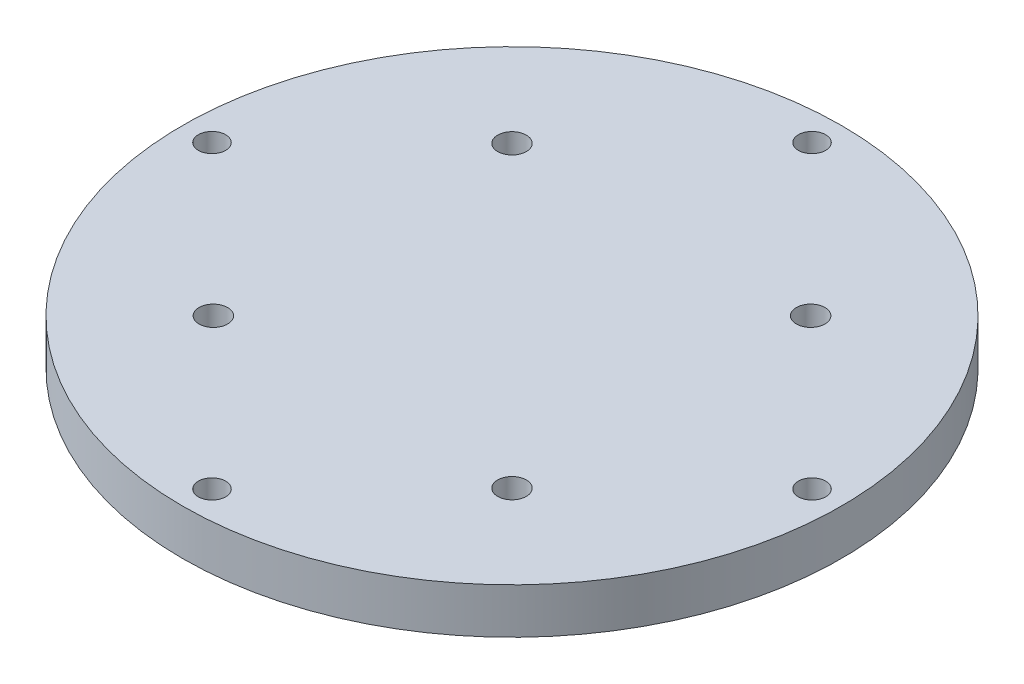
from build123d import *

# Parameters (mm, degrees)
SKETCH1_R           = 46.0375
SKETCH1_R_2         = 1.905
SKETCH1_R_3         = 2
BOSS_EXTRUDE1_DEPTH = 6.35


with BuildPart() as part:
    # Sketch1 → Boss-Extrude1 (new body)
    with BuildSketch(Plane(origin=(0, 0, 0), x_dir=(1, 0, 0), z_dir=(0, 1, 0))):
        with Locations(Location((0, 0, 0), (0, 0, 270))):
            Circle(SKETCH1_R)
        with Locations(Location((0, 41.91, 0), (0, 0, 270))):
            Circle(SKETCH1_R_2, mode=Mode.SUBTRACT)
        with Locations(Location((41.91, 0, 0), (0, 0, 270))):
            Circle(SKETCH1_R_2, mode=Mode.SUBTRACT)
        with Locations(Location((0, -41.91, 0), (0, 0, 270))):
            Circle(SKETCH1_R_2, mode=Mode.SUBTRACT)
        with Locations(Location((-41.91, 0, 0), (0, 0, 270))):
            Circle(SKETCH1_R_2, mode=Mode.SUBTRACT)
        with Locations(Location((-20.859650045, 20.859650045, 0), (0, 0, 270))):
            Circle(SKETCH1_R_3, mode=Mode.SUBTRACT)
        with Locations(Location((20.859650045, 20.859650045, 0), (0, 0, 270))):
            Circle(SKETCH1_R_3, mode=Mode.SUBTRACT)
        with Locations(Location((20.859650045, -20.859650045, 0), (0, 0, 270))):
            Circle(SKETCH1_R_3, mode=Mode.SUBTRACT)
        with Locations(Location((-20.859650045, -20.859650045, 0), (0, 0, 270))):
            Circle(SKETCH1_R_3, mode=Mode.SUBTRACT)
    extrude(amount=BOSS_EXTRUDE1_DEPTH)


solid = part.part
